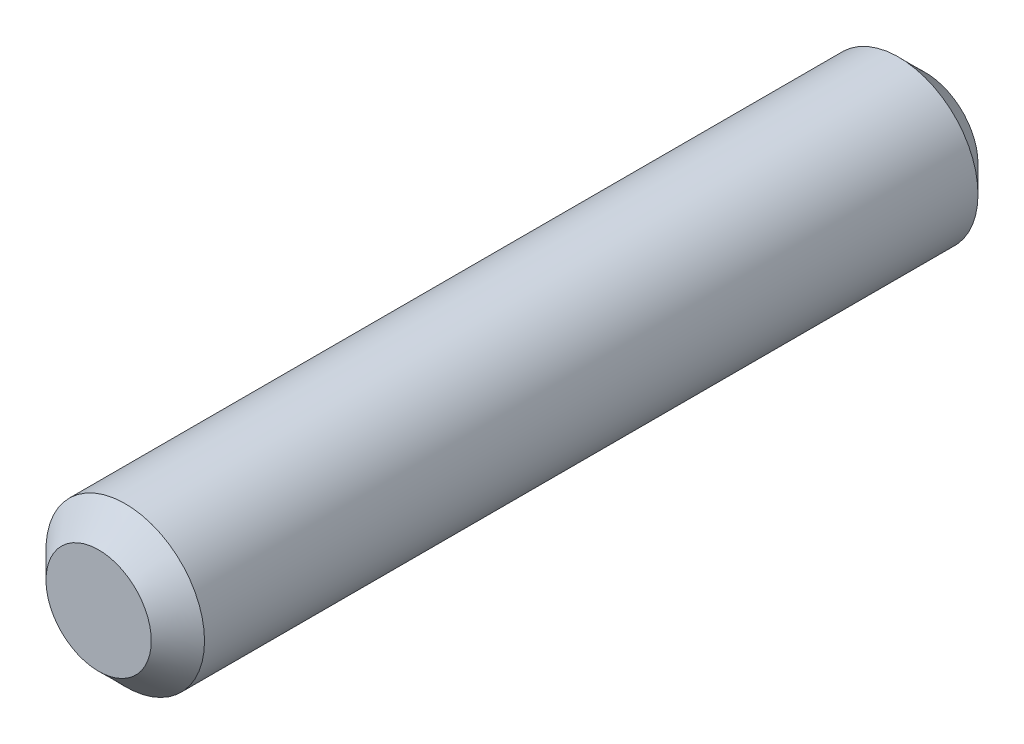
ISO-10303-21;
HEADER;
FILE_DESCRIPTION(('STEP AP214'),'2;1');
FILE_NAME('part.step','',(''),(''),'','','');
FILE_SCHEMA(('AUTOMOTIVE_DESIGN { 1 0 10303 214 1 1 1 1 }'));
ENDSEC;
DATA;
#1=APPLICATION_CONTEXT('core data for automotive mechanical design processes');
#2=APPLICATION_PROTOCOL_DEFINITION('international standard','automotive_design',2000,#1);
#3=PRODUCT_CONTEXT('',#1,'mechanical');
#4=PRODUCT('Part','Part','',(#3));
#5=PRODUCT_RELATED_PRODUCT_CATEGORY('part','',(#4));
#6=PRODUCT_DEFINITION_FORMATION('','',#4);
#7=PRODUCT_DEFINITION_CONTEXT('part definition',#1,'design');
#8=PRODUCT_DEFINITION('design','',#6,#7);
#9=PRODUCT_DEFINITION_SHAPE('','',#8);
#10=(LENGTH_UNIT() NAMED_UNIT(*) SI_UNIT(.MILLI.,.METRE.));
#11=(NAMED_UNIT(*) PLANE_ANGLE_UNIT() SI_UNIT($,.RADIAN.));
#12=(NAMED_UNIT(*) SI_UNIT($,.STERADIAN.) SOLID_ANGLE_UNIT());
#13=UNCERTAINTY_MEASURE_WITH_UNIT(LENGTH_MEASURE(1.E-05),#10,'distance_accuracy_value','');
#14=(GEOMETRIC_REPRESENTATION_CONTEXT(3) GLOBAL_UNCERTAINTY_ASSIGNED_CONTEXT((#13)) GLOBAL_UNIT_ASSIGNED_CONTEXT((#10,
#11,#12)) REPRESENTATION_CONTEXT('',''));
#15=CARTESIAN_POINT('',(0.,0.,0.));
#16=DIRECTION('',(0.,0.,1.));
#17=DIRECTION('',(1.,0.,0.));
#18=AXIS2_PLACEMENT_3D('',#15,#16,#17);
#19=CARTESIAN_POINT('',(0.,0.,6.1595));
#20=DIRECTION('',(0.,0.,-1.));
#21=DIRECTION('',(-1.,0.,0.));
#22=AXIS2_PLACEMENT_3D('',#19,#20,#21);
#23=PLANE('',#22);
#24=CARTESIAN_POINT('',(0.,0.,6.1595));
#25=DIRECTION('',(0.,0.,1.));
#26=DIRECTION('',(1.,0.,0.));
#27=AXIS2_PLACEMENT_3D('',#24,#25,#26);
#28=CIRCLE('',#27,0.784225);
#29=CARTESIAN_POINT('',(0.784225,0.,6.1595));
#30=VERTEX_POINT('',#29);
#31=EDGE_CURVE('E10',#30,#30,#28,.T.);
#32=ORIENTED_EDGE('',*,*,#31,.T.);
#33=EDGE_LOOP('',(#32));
#34=FACE_BOUND('',#33,.T.);
#35=ADVANCED_FACE('F33',(#34),#23,.F.);
#36=CARTESIAN_POINT('',(0.,0.,5.762625));
#37=DIRECTION('',(0.,0.,-1.));
#38=DIRECTION('',(-1.,0.,0.));
#39=AXIS2_PLACEMENT_3D('',#36,#37,#38);
#40=CONICAL_SURFACE('',#39,1.1811,0.785398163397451);
#41=ORIENTED_EDGE('',*,*,#31,.F.);
#42=EDGE_LOOP('',(#41));
#43=FACE_BOUND('',#42,.T.);
#44=CARTESIAN_POINT('',(0.,0.,5.762625));
#45=DIRECTION('',(0.,0.,1.));
#46=DIRECTION('',(1.,0.,0.));
#47=AXIS2_PLACEMENT_3D('',#44,#45,#46);
#48=CIRCLE('',#47,1.1811);
#49=CARTESIAN_POINT('',(1.1811,0.,5.762625));
#50=VERTEX_POINT('',#49);
#51=EDGE_CURVE('E39',#50,#50,#48,.T.);
#52=ORIENTED_EDGE('',*,*,#51,.T.);
#53=EDGE_LOOP('',(#52));
#54=FACE_BOUND('',#53,.T.);
#55=ADVANCED_FACE('F65',(#43,#54),#40,.T.);
#56=CARTESIAN_POINT('',(0.,0.,51.7889690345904));
#57=DIRECTION('',(0.,0.,1.));
#58=DIRECTION('',(1.,0.,0.));
#59=AXIS2_PLACEMENT_3D('',#56,#57,#58);
#60=CYLINDRICAL_SURFACE('',#59,1.1811);
#61=ORIENTED_EDGE('',*,*,#51,.F.);
#62=EDGE_LOOP('',(#61));
#63=FACE_BOUND('',#62,.T.);
#64=CARTESIAN_POINT('',(0.,0.,-5.762625));
#65=DIRECTION('',(0.,0.,1.));
#66=DIRECTION('',(1.,0.,0.));
#67=AXIS2_PLACEMENT_3D('',#64,#65,#66);
#68=CIRCLE('',#67,1.1811);
#69=CARTESIAN_POINT('',(1.1811,0.,-5.762625));
#70=VERTEX_POINT('',#69);
#71=EDGE_CURVE('E43',#70,#70,#68,.T.);
#72=ORIENTED_EDGE('',*,*,#71,.T.);
#73=EDGE_LOOP('',(#72));
#74=FACE_BOUND('',#73,.T.);
#75=ADVANCED_FACE('F61',(#63,#74),#60,.T.);
#76=CARTESIAN_POINT('',(0.,0.,-6.1595));
#77=DIRECTION('',(0.,0.,1.));
#78=DIRECTION('',(1.,0.,0.));
#79=AXIS2_PLACEMENT_3D('',#76,#77,#78);
#80=CONICAL_SURFACE('',#79,0.784225,0.785398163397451);
#81=ORIENTED_EDGE('',*,*,#71,.F.);
#82=EDGE_LOOP('',(#81));
#83=FACE_BOUND('',#82,.T.);
#84=CARTESIAN_POINT('',(0.,0.,-6.1595));
#85=DIRECTION('',(0.,0.,1.));
#86=DIRECTION('',(1.,0.,0.));
#87=AXIS2_PLACEMENT_3D('',#84,#85,#86);
#88=CIRCLE('',#87,0.784225);
#89=CARTESIAN_POINT('',(0.784225,0.,-6.1595));
#90=VERTEX_POINT('',#89);
#91=EDGE_CURVE('E47',#90,#90,#88,.T.);
#92=ORIENTED_EDGE('',*,*,#91,.T.);
#93=EDGE_LOOP('',(#92));
#94=FACE_BOUND('',#93,.T.);
#95=ADVANCED_FACE('F53',(#83,#94),#80,.T.);
#96=CARTESIAN_POINT('',(0.,0.,-6.1595));
#97=DIRECTION('',(0.,0.,1.));
#98=DIRECTION('',(1.,0.,0.));
#99=AXIS2_PLACEMENT_3D('',#96,#97,#98);
#100=PLANE('',#99);
#101=ORIENTED_EDGE('',*,*,#91,.F.);
#102=EDGE_LOOP('',(#101));
#103=FACE_BOUND('',#102,.T.);
#104=ADVANCED_FACE('F55',(#103),#100,.F.);
#105=CLOSED_SHELL('',(#35,#55,#75,#95,#104));
#106=MANIFOLD_SOLID_BREP('B2',#105);
#107=ADVANCED_BREP_SHAPE_REPRESENTATION('',(#18,#106),#14);
#108=SHAPE_DEFINITION_REPRESENTATION(#9,#107);
ENDSEC;
END-ISO-10303-21;
